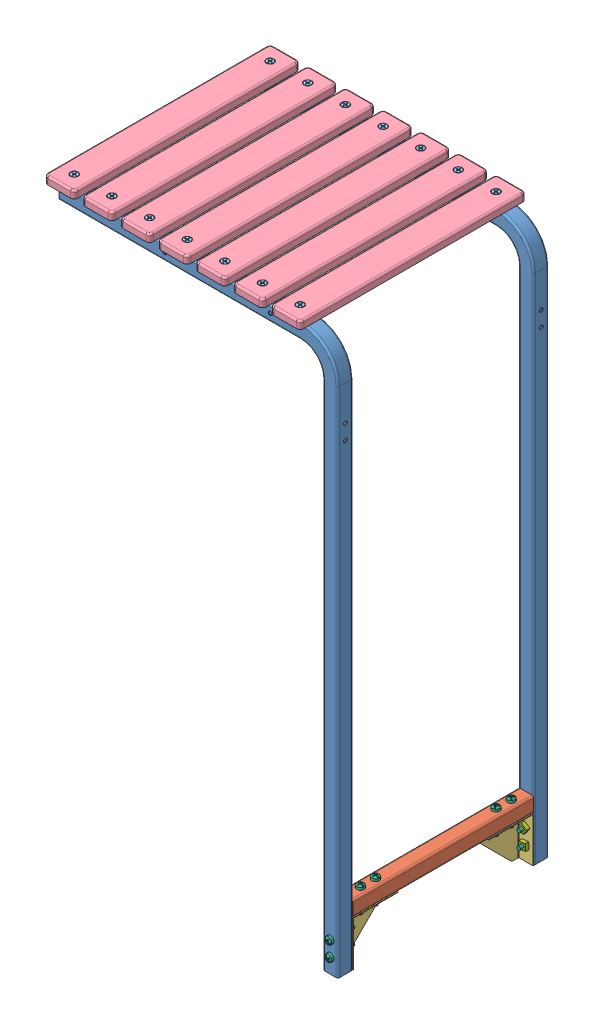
SolidWorks assembly Support_Frame_&.SLDASM, configuration Default (file format 8000). Lengths in mm.
Overall size (482.6 939.86 381).
43 component instances, 7 part files, 47 mates.
Components (placement in the parent):
- Support_Leg_&-1: Support_Leg_&.SLDPRT [Long Arm] at origin size (469.9 927.1 25.4)
- Support_Leg_&-2: Support_Leg_&.SLDPRT [Long Arm] at (0 0 -330.2) size (469.9 927.1 25.4)
- Lower_Brace_&-1: Lower_Brace_&.SLDASM [Default] at (457.2 -798.1188 -165.1) size (25.4 101.6 304.8)
  - Brace_Cross_Bar_&-1: Brace_Cross_Bar_&.SLDPRT [Plain] at (0 -27.3812 0) size (25.4 25.4 304.8)
  - Brace_Corner_&-1: Brace_Corner_&.SLDPRT [Default] at (-12.7 -40.0812 152.4) x (0 0 -1) z (1 0 0) size (76.2 76.2 25.4)
  - Brace_Corner_&-2: Brace_Corner_&.SLDPRT [Default] at (-12.7 -40.0812 -152.4) x (0 -1 0) z (1 0 0) size (76.2 76.2 25.4)
- Plank_&-15: Plank_&.SLDPRT [mahogony] at (12.7 12.7 -165.1) x (1 0 0) z (0 1 0) size (50.8 381 12.7)
- Plank_&-16: Plank_&.SLDPRT [mahogony] at (76.2 12.7 -165.1) x (1 0 0) z (0 1 0) size (50.8 381 12.7)
- Plank_&-17: Plank_&.SLDPRT [mahogony] at (139.7 12.7 -165.1) x (1 0 0) z (0 1 0) size (50.8 381 12.7)
- Plank_&-18: Plank_&.SLDPRT [mahogony] at (203.2 12.7 -165.1) x (1 0 0) z (0 1 0) size (50.8 381 12.7)
- Plank_&-19: Plank_&.SLDPRT [mahogony] at (266.7 12.7 -165.1) x (1 0 0) z (0 1 0) size (50.8 381 12.7)
- Plank_&-20: Plank_&.SLDPRT [mahogony] at (330.2 12.7 -165.1) x (1 0 0) z (0 1 0) size (50.8 381 12.7)
- Plank_&-21: Plank_&.SLDPRT [mahogony] at (393.7 12.7 -165.1) x (1 0 0) z (0 1 0) size (50.8 381 12.7)
- Flat Head Screw_&-1: Flat Head Screw_&.SLDPRT [1] at (12.7 25.4553 0) x (0 -1 0) z (0 0 1) size (19.05 11.23 11.23)
- Flat Head Screw_&-9: Flat Head Screw_&.SLDPRT [1] at (12.7 25.4553 -330.2) x (0 -1 0) z (0 0 1) size (19.05 11.23 11.23)
- Flat Head Screw_&-3: Flat Head Screw_&.SLDPRT [1] at (76.2 25.4553 0) x (0 -1 0) z (0 0 1) size (19.05 11.23 11.23)
- Flat Head Screw_&-4: Flat Head Screw_&.SLDPRT [1] at (139.7 25.4553 0) x (0 -1 0) z (0 0 1) size (19.05 11.23 11.23)
- Flat Head Screw_&-5: Flat Head Screw_&.SLDPRT [1] at (203.2 25.4553 0) x (0 -1 0) z (0 0 1) size (19.05 11.23 11.23)
- Flat Head Screw_&-6: Flat Head Screw_&.SLDPRT [1] at (266.7 25.4553 0) x (0 -1 0) z (0 0 1) size (19.05 11.23 11.23)
- Flat Head Screw_&-7: Flat Head Screw_&.SLDPRT [1] at (330.2 25.4553 0) x (0 -1 0) z (0 0 1) size (19.05 11.23 11.23)
- Flat Head Screw_&-8: Flat Head Screw_&.SLDPRT [1] at (393.7 25.4553 0) x (0 -1 0) z (0 0 1) size (19.05 11.23 11.23)
- Flat Head Screw_&-10: Flat Head Screw_&.SLDPRT [1] at (76.2 25.4553 -330.2) x (0 -1 0) z (0 0 1) size (19.05 11.23 11.23)
- Flat Head Screw_&-11: Flat Head Screw_&.SLDPRT [1] at (139.7 25.4553 -330.2) x (0 -1 0) z (0 0 1) size (19.05 11.23 11.23)
- Flat Head Screw_&-12: Flat Head Screw_&.SLDPRT [1] at (203.2 25.4553 -330.2) x (0 -1 0) z (0 0 1) size (19.05 11.23 11.23)
- Flat Head Screw_&-13: Flat Head Screw_&.SLDPRT [1] at (266.7 25.4553 -330.2) x (0 -1 0) z (0 0 1) size (19.05 11.23 11.23)
- Flat Head Screw_&-14: Flat Head Screw_&.SLDPRT [1] at (330.2 25.4553 -330.2) x (0 -1 0) z (0 0 1) size (19.05 11.23 11.23)
- Flat Head Screw_&-15: Flat Head Screw_&.SLDPRT [1] at (393.7 25.4553 -330.2) x (0 -1 0) z (0 0 1) size (19.05 11.23 11.23)
- Binding Head Screw_&-1: Binding Head Screw_&.SLDPRT [1] at (457.2 -806.6024 -38.1) x (0 -1 0) z (-0.995354 0 -0.096286) size (44.18 12.7 12.7)
- Square Nut_&-1: Square Nut_&.SLDPRT [1] at (457.2 -845.185 -38.1) x (0.9999 0 -0.014161) z (0 -1 0) size (15.73 15.73 5.97)
- Binding Head Screw_&-2: Binding Head Screw_&.SLDPRT [1] at (457.2 -806.6024 -63.5) x (0 -1 0) z (0.997911 0 0.064603) size (44.18 12.7 12.7)
- Square Nut_&-2: Square Nut_&.SLDPRT [1] at (457.2 -845.185 -63.5) x (-0.638951 0 0.769248) z (0 -1 0) size (15.73 15.73 5.97)
- Binding Head Screw_&-3: Binding Head Screw_&.SLDPRT [1] at (457.2 -863.6 18.8976) x (0 0 -1) z (-0.864559 0.502531 0) size (44.18 12.7 12.7)
- Binding Head Screw_&-4: Binding Head Screw_&.SLDPRT [1] at (457.2 -889 18.8976) x (0 0 -1) z (-0.551669 0.834063 0) size (44.18 12.7 12.7)
- Square Nut_&-3: Square Nut_&.SLDPRT [1] at (457.2 -863.6 -19.685) x (-0.998745 0.050081 0) z (0 0 -1) size (15.73 15.73 5.97)
- Square Nut_&-4: Square Nut_&.SLDPRT [1] at (457.2 -889 -19.685) x (0.458326 0.888784 0) z (0 0 -1) size (15.73 15.73 5.97)
- Binding Head Screw_&-5: Binding Head Screw_&.SLDPRT [1] at (457.2 -806.6024 -266.7) x (0 -1 0) z (-0.459324 0 -0.888269) size (44.18 12.7 12.7)
- Binding Head Screw_&-6: Binding Head Screw_&.SLDPRT [1] at (457.2 -806.6024 -292.1) x (0 -1 0) z (0.753871 0 0.657022) size (44.18 12.7 12.7)
- Binding Head Screw_&-7: Binding Head Screw_&.SLDPRT [1] at (457.2 -863.6 -349.0976) x (0 0 1) z (-0.999516 0.031099 0) size (44.18 12.7 12.7)
- Binding Head Screw_&-8: Binding Head Screw_&.SLDPRT [1] at (457.2 -889 -349.0976) x (0 0 1) z (0.68329 0.730147 0) size (44.18 12.7 12.7)
- Square Nut_&-5: Square Nut_&.SLDPRT [1] at (457.2 -845.185 -266.7) x (-0.502308 0 -0.864689) z (0 -1 0) size (15.73 15.73 5.97)
- Square Nut_&-6: Square Nut_&.SLDPRT [1] at (457.2 -845.185 -292.1) x (0.672374 0 -0.740212) z (0 -1 0) size (15.73 15.73 5.97)
- Square Nut_&-7: Square Nut_&.SLDPRT [1] at (457.2 -863.6 -310.515) x (-0.973807 -0.227375 0) z (0 0 1) size (15.73 15.73 5.97)
- Square Nut_&-8: Square Nut_&.SLDPRT [1] at (457.2 -889 -310.515) x (-0.758783 0.651343 0) z (0 0 1) size (15.73 15.73 5.97)
Mates (geometry in assembly coordinates):
- Coincident1: coincident aligned: plane of Support_Leg_&-1 through (469.9 -50.8 12.7) normal (1 0 0); plane of Support_Leg_&-2 through (469.9 -50.8 -317.5) normal (1 0 0)
- Coincident2: coincident aligned: plane of Support_Leg_&-1 through (406.4 12.7 12.7) normal (0 1 0); plane of Support_Leg_&-2 through (406.4 12.7 -317.5) normal (0 1 0)
- Perpendicular2: perpendicular: plane of Support_Leg_&-1 through (406.4 12.7 12.7) normal (0 0 1); plane of ?
- Coincident15: coincident anti-aligned: plane of Support_Leg_&-1 through (406.4 12.7 12.7) normal (0 1 0); plane of Plank_&-15 through (38.1 12.7 -355.6) normal (0 -1 0)
- Concentric1: concentric aligned: cylinder of Support_Leg_&-1 through (12.7 -914.401 0) axis (0 1 0) radius 3.175; cylinder of Plank_&-15 through (12.7 25.4 0) axis (0 1 0) radius 3.3782
- Perpendicular1: perpendicular: plane of Support_Leg_&-1 through (406.4 12.7 12.7) normal (0 0 1); plane of Plank_&-15 through (38.1 25.4 25.4) normal (1 0 0)
- Coincident31: coincident aligned: plane of Support_Leg_&-1 through (469.9 -50.8 12.7) normal (1 0 0); plane of Lower_Brace_&-1/Brace_Cross_Bar_&-1 through (469.9 -838.2 -12.7) normal (1 0 0)
- Coincident32: coincident anti-aligned: plane of Support_Leg_&-1 through (406.4 -12.7 -12.7) normal (0 0 -1); plane of Lower_Brace_&-1/Brace_Cross_Bar_&-1 through (444.5 -838.2 -12.7) normal (0 0 1)
- Coincident33: coincident anti-aligned: plane of Support_Leg_&-2 through (406.4 12.7 -317.5) normal (0 0 1); plane of Lower_Brace_&-1/Brace_Cross_Bar_&-1 through (444.5 -838.2 -317.5) normal (0 0 -1)
- Coincident35: coincident anti-aligned: plane of Support_Leg_&-1 through (406.4 -12.7 -12.7) normal (0 0 -1); plane of Lower_Brace_&-1/Brace_Corner_&-1 through (469.9 -457.2 -12.7) normal (0 0 1)
- Concentric17: concentric anti-aligned: cylinder of Support_Leg_&-1 through (457.2 -863.6 12.7) axis (0 0 -1) radius 3.5719; cylinder of Lower_Brace_&-1/Brace_Corner_&-1 through (457.2 -863.6 -12.7) axis (0 0 1) radius 3.175
- Coincident37: coincident anti-aligned: plane of Support_Leg_&-2 through (406.4 12.7 -317.5) normal (0 0 1); plane of Lower_Brace_&-1/Brace_Corner_&-2 through (469.9 -914.4 -317.5) normal (0 0 -1)
- Concentric18: concentric aligned: cylinder of Support_Leg_&-2 through (457.2 -889 -317.5) axis (0 0 -1) radius 3.5719; cylinder of Lower_Brace_&-1/Brace_Corner_&-2 through (457.2 -889 -317.5) axis (0 0 -1) radius 3.175
- Coincident38: coincident aligned: cone of Plank_&-15 through (12.7 25.4 0) axis (0 -1 0); cone of Flat Head Screw_&-1 through (12.7 24.7073 0) axis (0 -1 0)
- Coincident39: coincident aligned: cone of Plank_&-15 through (12.7 25.4 -330.2) axis (0 -1 0); cone of Flat Head Screw_&-9 through (12.7 24.7073 -330.2) axis (0 -1 0)
- Concentric22: concentric anti-aligned: cylinder of Lower_Brace_&-1/Brace_Cross_Bar_&-1 through (457.2 -812.8 -38.1) axis (0 -1 0) radius 3.175; cylinder of Binding Head Screw_&-1 through (457.2 -781.2024 -38.1) axis (0 1 0) radius 3.175
- Coincident41: coincident anti-aligned: plane of Lower_Brace_&-1/Brace_Cross_Bar_&-1 through (444.5 -812.8 -12.7) normal (0 1 0); plane of Binding Head Screw_&-1 through (456.8943 -812.8 -34.9398) normal (0 -1 0)
- Concentric23: concentric anti-aligned: cylinder of Binding Head Screw_&-1 through (457.2 -781.2024 -38.1) axis (0 1 0) radius 3.175; cylinder of Square Nut_&-1 through (457.2 -839.216 -38.1) axis (0 -1 0) radius 2.5527
- Coincident42: coincident anti-aligned: plane of Lower_Brace_&-1/Brace_Corner_&-1 through (469.9 -839.216 -88.9) normal (0 -1 0); plane of Square Nut_&-1 through (457.0886 -839.216 -45.9659) normal (0 1 0)
- Concentric24: concentric anti-aligned: cylinder of Lower_Brace_&-1/Brace_Cross_Bar_&-1 through (457.2 -812.8 -63.5) axis (0 -1 0) radius 3.175; cylinder of Binding Head Screw_&-2 through (457.2 -781.2024 -63.5) axis (0 1 0) radius 3.175
- Coincident43: coincident anti-aligned: plane of Lower_Brace_&-1/Brace_Cross_Bar_&-1 through (444.5 -812.8 -12.7) normal (0 1 0); plane of Binding Head Screw_&-2 through (457.4051 -812.8 -66.6684) normal (0 -1 0)
- Concentric25: concentric anti-aligned: cylinder of Binding Head Screw_&-2 through (457.2 -781.2024 -63.5) axis (0 1 0) radius 3.175; cylinder of Square Nut_&-2 through (457.2 -839.216 -63.5) axis (0 -1 0) radius 2.5527
- Coincident44: coincident anti-aligned: plane of Lower_Brace_&-1/Brace_Corner_&-1 through (469.9 -839.216 -88.9) normal (0 -1 0); plane of Square Nut_&-2 through (463.2514 -839.216 -58.4736) normal (0 1 0)
- Concentric26: concentric anti-aligned: cylinder of Support_Leg_&-1 through (457.2 -863.6 12.7) axis (0 0 -1) radius 3.5719; cylinder of Binding Head Screw_&-3 through (457.2 -863.6 44.2976) axis (0 0 1) radius 3.175
- Coincident45: coincident anti-aligned: plane of Support_Leg_&-1 through (406.4 12.7 12.7) normal (0 0 1); plane of Binding Head Screw_&-3 through (455.6045 -866.345 12.7) normal (0 0 -1)
- Concentric27: concentric anti-aligned: cylinder of Support_Leg_&-1 through (457.2 -889 12.7) axis (0 0 -1) radius 3.5719; cylinder of Binding Head Screw_&-4 through (457.2 -889 44.2976) axis (0 0 1) radius 3.175
- Coincident46: coincident anti-aligned: plane of Support_Leg_&-1 through (406.4 12.7 12.7) normal (0 0 1); plane of Binding Head Screw_&-4 through (454.5518 -890.7515 12.7) normal (0 0 -1)
- Concentric28: concentric anti-aligned: cylinder of Binding Head Screw_&-4 through (457.2 -889 44.2976) axis (0 0 1) radius 3.175; cylinder of Square Nut_&-4 through (457.2 -889 5.3525) axis (0 0 -1) radius 3.175
- Coincident47: coincident anti-aligned: plane of Lower_Brace_&-1/Brace_Corner_&-1 through (469.9 -457.2 -13.716) normal (0 0 -1); plane of Square Nut_&-4 through (450.2082 -885.3945 -13.716) normal (0 0 1)
- Concentric29: concentric anti-aligned: cylinder of Binding Head Screw_&-3 through (457.2 -863.6 44.2976) axis (0 0 1) radius 3.175; cylinder of Square Nut_&-3 through (457.2 -863.6 5.3525) axis (0 0 -1) radius 3.175
- Coincident48: coincident anti-aligned: plane of Lower_Brace_&-1/Brace_Corner_&-1 through (469.9 -457.2 -13.716) normal (0 0 -1); plane of Square Nut_&-3 through (456.806 -871.4568 -13.716) normal (0 0 1)
- Concentric30: concentric anti-aligned: cylinder of Lower_Brace_&-1/Brace_Cross_Bar_&-1 through (457.2 -812.8 -266.7) axis (0 -1 0) radius 3.175; cylinder of Binding Head Screw_&-5 through (457.2 -781.2024 -266.7) axis (0 1 0) radius 3.175
- Coincident50: coincident anti-aligned: plane of Lower_Brace_&-1/Brace_Cross_Bar_&-1 through (444.5 -812.8 -12.7) normal (0 1 0); plane of Binding Head Screw_&-5 through (454.3797 -812.8 -265.2416) normal (0 -1 0)
- Concentric31: concentric anti-aligned: cylinder of Lower_Brace_&-1/Brace_Cross_Bar_&-1 through (457.2 -812.8 -292.1) axis (0 -1 0) radius 3.175; cylinder of Binding Head Screw_&-6 through (457.2 -781.2024 -292.1) axis (0 1 0) radius 3.175
- Coincident51: coincident anti-aligned: plane of Lower_Brace_&-1/Brace_Cross_Bar_&-1 through (444.5 -812.8 -12.7) normal (0 1 0); plane of Binding Head Screw_&-6 through (459.286 -812.8 -294.4935) normal (0 -1 0)
- Concentric32: concentric aligned: cylinder of Support_Leg_&-2 through (457.2 -863.6 -317.5) axis (0 0 -1) radius 3.5719; cylinder of Binding Head Screw_&-7 through (457.2 -863.6 -374.4976) axis (0 0 -1) radius 3.175
- Coincident52: coincident anti-aligned: plane of Support_Leg_&-2 through (406.4 -12.7 -342.9) normal (0 0 -1); plane of Binding Head Screw_&-7 through (457.2987 -860.4265 -342.9) normal (0 0 1)
- Concentric33: concentric aligned: cylinder of Support_Leg_&-2 through (457.2 -889 -317.5) axis (0 0 -1) radius 3.5719; cylinder of Binding Head Screw_&-8 through (457.2 -889 -374.4976) axis (0 0 -1) radius 3.175
- Coincident53: coincident anti-aligned: plane of Support_Leg_&-2 through (406.4 -12.7 -342.9) normal (0 0 -1); plane of Binding Head Screw_&-8 through (459.5182 -891.1694 -342.9) normal (0 0 1)
- Concentric34: concentric anti-aligned: cylinder of Binding Head Screw_&-5 through (457.2 -781.2024 -266.7) axis (0 1 0) radius 3.175; cylinder of Square Nut_&-5 through (457.2 -820.1475 -266.7) axis (0 -1 0) radius 3.175
- Coincident54: coincident anti-aligned: plane of Lower_Brace_&-1/Brace_Corner_&-2 through (469.9 -839.216 -698.5) normal (0 -1 0); plane of Square Nut_&-5 through (450.3977 -839.216 -262.7485) normal (0 1 0)
- Concentric35: concentric anti-aligned: cylinder of Binding Head Screw_&-6 through (457.2 -781.2024 -292.1) axis (0 1 0) radius 3.175; cylinder of Square Nut_&-6 through (457.2 -820.1475 -292.1) axis (0 -1 0) radius 3.175
- Coincident55: coincident anti-aligned: plane of Lower_Brace_&-1/Brace_Corner_&-2 through (469.9 -839.216 -698.5) normal (0 -1 0); plane of Square Nut_&-6 through (451.377 -839.216 -297.3894) normal (0 1 0)
- Concentric36: concentric anti-aligned: cylinder of Lower_Brace_&-1/Brace_Corner_&-2 through (457.2 -863.6 -317.5) axis (0 0 -1) radius 3.175; cylinder of Square Nut_&-7 through (457.2 -863.6 -335.5525) axis (0 0 1) radius 3.175
- Coincident56: coincident anti-aligned: plane of Lower_Brace_&-1/Brace_Corner_&-2 through (469.9 -914.4 -316.484) normal (0 0 1); plane of Square Nut_&-7 through (455.4113 -855.9393 -316.484) normal (0 0 -1)
- Concentric37: concentric anti-aligned: cylinder of Lower_Brace_&-1/Brace_Corner_&-2 through (457.2 -889 -317.5) axis (0 0 -1) radius 3.175; cylinder of Square Nut_&-8 through (457.2 -889 -335.5525) axis (0 0 1) radius 3.175
- Coincident57: coincident anti-aligned: plane of Lower_Brace_&-1/Brace_Corner_&-2 through (469.9 -914.4 -316.484) normal (0 0 1); plane of Square Nut_&-8 through (462.3239 -883.0309 -316.484) normal (0 0 -1)
